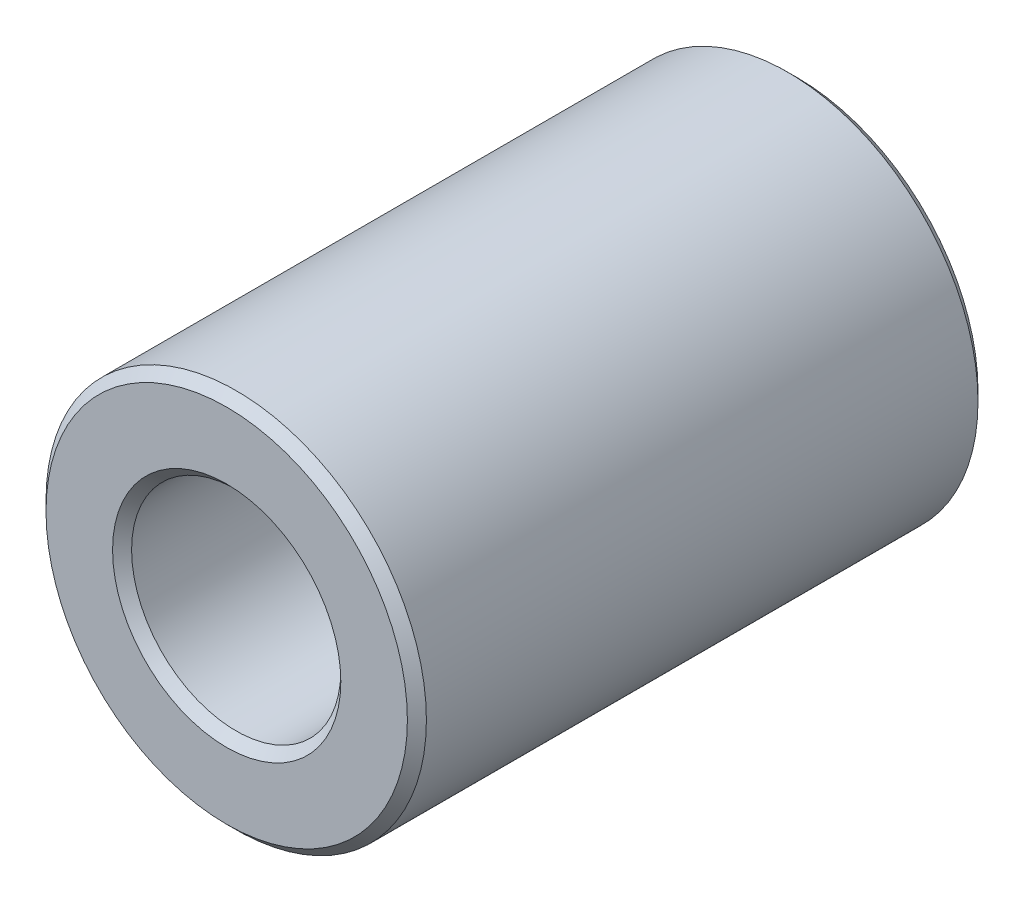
ISO-10303-21;
HEADER;
FILE_DESCRIPTION(('STEP AP214'),'2;1');
FILE_NAME('part.step','',(''),(''),'','','');
FILE_SCHEMA(('AUTOMOTIVE_DESIGN { 1 0 10303 214 1 1 1 1 }'));
ENDSEC;
DATA;
#1=APPLICATION_CONTEXT('core data for automotive mechanical design processes');
#2=APPLICATION_PROTOCOL_DEFINITION('international standard','automotive_design',2000,#1);
#3=PRODUCT_CONTEXT('',#1,'mechanical');
#4=PRODUCT('Part','Part','',(#3));
#5=PRODUCT_RELATED_PRODUCT_CATEGORY('part','',(#4));
#6=PRODUCT_DEFINITION_FORMATION('','',#4);
#7=PRODUCT_DEFINITION_CONTEXT('part definition',#1,'design');
#8=PRODUCT_DEFINITION('design','',#6,#7);
#9=PRODUCT_DEFINITION_SHAPE('','',#8);
#10=(LENGTH_UNIT() NAMED_UNIT(*) SI_UNIT(.MILLI.,.METRE.));
#11=(NAMED_UNIT(*) PLANE_ANGLE_UNIT() SI_UNIT($,.RADIAN.));
#12=(NAMED_UNIT(*) SI_UNIT($,.STERADIAN.) SOLID_ANGLE_UNIT());
#13=UNCERTAINTY_MEASURE_WITH_UNIT(LENGTH_MEASURE(1.E-05),#10,'distance_accuracy_value','');
#14=(GEOMETRIC_REPRESENTATION_CONTEXT(3) GLOBAL_UNCERTAINTY_ASSIGNED_CONTEXT((#13)) GLOBAL_UNIT_ASSIGNED_CONTEXT((#10,
#11,#12)) REPRESENTATION_CONTEXT('',''));
#15=CARTESIAN_POINT('',(0.,0.,0.));
#16=DIRECTION('',(0.,0.,1.));
#17=DIRECTION('',(1.,0.,0.));
#18=AXIS2_PLACEMENT_3D('',#15,#16,#17);
#19=CARTESIAN_POINT('',(0.,0.,3.));
#20=DIRECTION('',(0.,0.,1.));
#21=DIRECTION('',(1.,0.,0.));
#22=AXIS2_PLACEMENT_3D('',#19,#20,#21);
#23=PLANE('',#22);
#24=CARTESIAN_POINT('',(0.,0.,3.));
#25=DIRECTION('',(0.,0.,1.));
#26=DIRECTION('',(1.,0.,0.));
#27=AXIS2_PLACEMENT_3D('',#24,#25,#26);
#28=CIRCLE('',#27,1.2);
#29=CARTESIAN_POINT('',(1.2,0.,3.));
#30=VERTEX_POINT('',#29);
#31=EDGE_CURVE('E10',#30,#30,#28,.F.);
#32=ORIENTED_EDGE('',*,*,#31,.T.);
#33=EDGE_LOOP('',(#32));
#34=FACE_BOUND('',#33,.T.);
#35=CARTESIAN_POINT('',(0.,0.,3.));
#36=DIRECTION('',(0.,0.,1.));
#37=DIRECTION('',(1.,0.,0.));
#38=AXIS2_PLACEMENT_3D('',#35,#36,#37);
#39=CIRCLE('',#38,1.9);
#40=CARTESIAN_POINT('',(1.9,0.,3.));
#41=VERTEX_POINT('',#40);
#42=EDGE_CURVE('E45',#41,#41,#39,.T.);
#43=ORIENTED_EDGE('',*,*,#42,.T.);
#44=EDGE_LOOP('',(#43));
#45=FACE_BOUND('',#44,.T.);
#46=ADVANCED_FACE('F37',(#34,#45),#23,.T.);
#47=CARTESIAN_POINT('',(0.,0.,-3.));
#48=DIRECTION('',(0.,0.,1.));
#49=DIRECTION('',(1.,0.,0.));
#50=AXIS2_PLACEMENT_3D('',#47,#48,#49);
#51=PLANE('',#50);
#52=CARTESIAN_POINT('',(0.,0.,-3.));
#53=DIRECTION('',(0.,0.,1.));
#54=DIRECTION('',(1.,0.,0.));
#55=AXIS2_PLACEMENT_3D('',#52,#53,#54);
#56=CIRCLE('',#55,1.9);
#57=CARTESIAN_POINT('',(1.9,0.,-3.));
#58=VERTEX_POINT('',#57);
#59=EDGE_CURVE('E64',#58,#58,#56,.F.);
#60=ORIENTED_EDGE('',*,*,#59,.T.);
#61=EDGE_LOOP('',(#60));
#62=FACE_BOUND('',#61,.T.);
#63=CARTESIAN_POINT('',(0.,0.,-3.));
#64=DIRECTION('',(0.,0.,1.));
#65=DIRECTION('',(1.,0.,0.));
#66=AXIS2_PLACEMENT_3D('',#63,#64,#65);
#67=CIRCLE('',#66,1.2);
#68=CARTESIAN_POINT('',(1.2,0.,-3.));
#69=VERTEX_POINT('',#68);
#70=EDGE_CURVE('E67',#69,#69,#67,.T.);
#71=ORIENTED_EDGE('',*,*,#70,.T.);
#72=EDGE_LOOP('',(#71));
#73=FACE_BOUND('',#72,.T.);
#74=ADVANCED_FACE('F89',(#62,#73),#51,.F.);
#75=CARTESIAN_POINT('',(0.,0.,3.));
#76=DIRECTION('',(0.,0.,-1.));
#77=DIRECTION('',(-1.,0.,0.));
#78=AXIS2_PLACEMENT_3D('',#75,#76,#77);
#79=CYLINDRICAL_SURFACE('',#78,2.);
#80=CARTESIAN_POINT('',(0.,0.,-2.9));
#81=DIRECTION('',(0.,0.,1.));
#82=DIRECTION('',(1.,0.,0.));
#83=AXIS2_PLACEMENT_3D('',#80,#81,#82);
#84=CIRCLE('',#83,2.);
#85=CARTESIAN_POINT('',(2.,0.,-2.9));
#86=VERTEX_POINT('',#85);
#87=EDGE_CURVE('E70',#86,#86,#84,.T.);
#88=ORIENTED_EDGE('',*,*,#87,.T.);
#89=EDGE_LOOP('',(#88));
#90=FACE_BOUND('',#89,.T.);
#91=CARTESIAN_POINT('',(0.,0.,2.9));
#92=DIRECTION('',(0.,0.,1.));
#93=DIRECTION('',(1.,0.,0.));
#94=AXIS2_PLACEMENT_3D('',#91,#92,#93);
#95=CIRCLE('',#94,2.);
#96=CARTESIAN_POINT('',(2.,0.,2.9));
#97=VERTEX_POINT('',#96);
#98=EDGE_CURVE('E74',#97,#97,#95,.F.);
#99=ORIENTED_EDGE('',*,*,#98,.T.);
#100=EDGE_LOOP('',(#99));
#101=FACE_BOUND('',#100,.T.);
#102=ADVANCED_FACE('F78',(#90,#101),#79,.T.);
#103=CARTESIAN_POINT('',(0.,0.,3.));
#104=DIRECTION('',(0.,0.,-1.));
#105=DIRECTION('',(-1.,0.,0.));
#106=AXIS2_PLACEMENT_3D('',#103,#104,#105);
#107=CYLINDRICAL_SURFACE('',#106,1.1);
#108=CARTESIAN_POINT('',(0.,0.,-2.9));
#109=DIRECTION('',(0.,0.,1.));
#110=DIRECTION('',(1.,0.,0.));
#111=AXIS2_PLACEMENT_3D('',#108,#109,#110);
#112=CIRCLE('',#111,1.1);
#113=CARTESIAN_POINT('',(1.1,0.,-2.9));
#114=VERTEX_POINT('',#113);
#115=EDGE_CURVE('E52',#114,#114,#112,.F.);
#116=ORIENTED_EDGE('',*,*,#115,.T.);
#117=EDGE_LOOP('',(#116));
#118=FACE_BOUND('',#117,.T.);
#119=CARTESIAN_POINT('',(0.,0.,2.9));
#120=DIRECTION('',(0.,0.,1.));
#121=DIRECTION('',(1.,0.,0.));
#122=AXIS2_PLACEMENT_3D('',#119,#120,#121);
#123=CIRCLE('',#122,1.1);
#124=CARTESIAN_POINT('',(1.1,0.,2.9));
#125=VERTEX_POINT('',#124);
#126=EDGE_CURVE('E58',#125,#125,#123,.T.);
#127=ORIENTED_EDGE('',*,*,#126,.T.);
#128=EDGE_LOOP('',(#127));
#129=FACE_BOUND('',#128,.T.);
#130=ADVANCED_FACE('F97',(#118,#129),#107,.F.);
#131=CARTESIAN_POINT('',(0.,0.,-2.9));
#132=DIRECTION('',(0.,0.,1.));
#133=DIRECTION('',(1.,0.,0.));
#134=AXIS2_PLACEMENT_3D('',#131,#132,#133);
#135=CONICAL_SURFACE('',#134,2.,0.785398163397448);
#136=ORIENTED_EDGE('',*,*,#59,.F.);
#137=EDGE_LOOP('',(#136));
#138=FACE_BOUND('',#137,.T.);
#139=ORIENTED_EDGE('',*,*,#87,.F.);
#140=EDGE_LOOP('',(#139));
#141=FACE_BOUND('',#140,.T.);
#142=ADVANCED_FACE('F102',(#138,#141),#135,.T.);
#143=CARTESIAN_POINT('',(0.,0.,-3.));
#144=DIRECTION('',(0.,0.,-1.));
#145=DIRECTION('',(-1.,0.,0.));
#146=AXIS2_PLACEMENT_3D('',#143,#144,#145);
#147=CONICAL_SURFACE('',#146,1.2,0.785398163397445);
#148=ORIENTED_EDGE('',*,*,#115,.F.);
#149=EDGE_LOOP('',(#148));
#150=FACE_BOUND('',#149,.T.);
#151=ORIENTED_EDGE('',*,*,#70,.F.);
#152=EDGE_LOOP('',(#151));
#153=FACE_BOUND('',#152,.T.);
#154=ADVANCED_FACE('F86',(#150,#153),#147,.F.);
#155=CARTESIAN_POINT('',(0.,0.,2.9));
#156=DIRECTION('',(0.,0.,1.));
#157=DIRECTION('',(1.,0.,0.));
#158=AXIS2_PLACEMENT_3D('',#155,#156,#157);
#159=CONICAL_SURFACE('',#158,1.1,0.785398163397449);
#160=ORIENTED_EDGE('',*,*,#31,.F.);
#161=EDGE_LOOP('',(#160));
#162=FACE_BOUND('',#161,.T.);
#163=ORIENTED_EDGE('',*,*,#126,.F.);
#164=EDGE_LOOP('',(#163));
#165=FACE_BOUND('',#164,.T.);
#166=ADVANCED_FACE('F82',(#162,#165),#159,.F.);
#167=CARTESIAN_POINT('',(0.,0.,3.));
#168=DIRECTION('',(0.,0.,-1.));
#169=DIRECTION('',(-1.,0.,0.));
#170=AXIS2_PLACEMENT_3D('',#167,#168,#169);
#171=CONICAL_SURFACE('',#170,1.9,0.78539816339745);
#172=ORIENTED_EDGE('',*,*,#98,.F.);
#173=EDGE_LOOP('',(#172));
#174=FACE_BOUND('',#173,.T.);
#175=ORIENTED_EDGE('',*,*,#42,.F.);
#176=EDGE_LOOP('',(#175));
#177=FACE_BOUND('',#176,.T.);
#178=ADVANCED_FACE('F39',(#174,#177),#171,.T.);
#179=CLOSED_SHELL('',(#46,#74,#102,#130,#142,#154,#166,#178));
#180=MANIFOLD_SOLID_BREP('B2',#179);
#181=ADVANCED_BREP_SHAPE_REPRESENTATION('',(#18,#180),#14);
#182=SHAPE_DEFINITION_REPRESENTATION(#9,#181);
ENDSEC;
END-ISO-10303-21;
